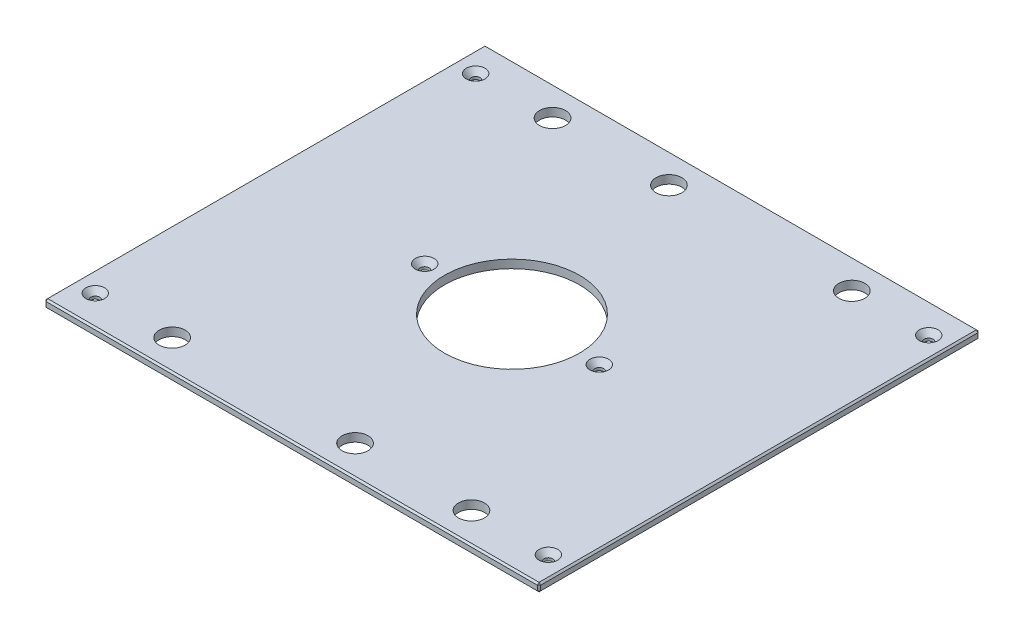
from build123d import *

# Parameters (mm, degrees)
SKETCH1_W                                     = 377.825
SKETCH1_H                                     = 336.55
BOSS_EXTRUDE1_DEPTH                           = 6.35
SKETCH13_R                                    = 51.562
CUT_EXTRUDE6_DEPTH                            = 254.07060434
F_25_32_0_78125_DIAMETER_HOLE1_D              = 19.84375
CHAMFER2_SIZE                                 = 1.27
CSK_FOR_1_4_FLAT_HEAD_MACHINE_SCREW1_AT_COUNT = 2
CSK_FOR_1_4_FLAT_HEAD_MACHINE_SCREW1_AT_PITCH = 290.50996
CSK_FOR_1_4_FLAT_HEAD_MACHINE_SCREW1_2_COUNT  = 2
CSK_FOR_1_4_FLAT_HEAD_MACHINE_SCREW1_2_PITCH  = 451.845042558
CSK_FOR_1_4_FLAT_HEAD_MACHINE_SCREW1_3_COUNT  = 2
CSK_FOR_1_4_FLAT_HEAD_MACHINE_SCREW1_3_PITCH  = 280.287516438
CSK_FOR_1_4_FLAT_HEAD_MACHINE_SCREW1_4_COUNT  = 2
CSK_FOR_1_4_FLAT_HEAD_MACHINE_SCREW1_4_PITCH  = 180.0333042
CSK_FOR_1_4_FLAT_HEAD_MACHINE_SCREW1_5_COUNT  = 2
CSK_FOR_1_4_FLAT_HEAD_MACHINE_SCREW1_5_PITCH  = 346.075
CSK_FOR_1_4_FLAT_HEAD_MACHINE_SCREW1_6_COUNT  = 2
CSK_FOR_1_4_FLAT_HEAD_MACHINE_SCREW1_6_PITCH  = 287.3375
CSK_FOR_1_4_FLAT_HEAD_MACHINE_SCREW1_7_COUNT  = 2
CSK_FOR_1_4_FLAT_HEAD_MACHINE_SCREW1_7_PITCH  = 408.606015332


with BuildPart() as part:
    # Sketch1 → Boss-Extrude1 (new body)
    with BuildSketch(Plane(origin=(0, 0, 0), x_dir=(1, 0, 0), z_dir=(0, 1, 0))):
        Rectangle(SKETCH1_W, SKETCH1_H)
    extrude(amount=BOSS_EXTRUDE1_DEPTH)

    # Sketch13 → Cut-Extrude6 (cut, through all)
    with BuildSketch(Plane(origin=(0, 6.35, 0), x_dir=(1, 0, 0), z_dir=(0, 1, 0))):
        with Locations(Location((0, 0, 0), (0, 0, 270))):
            Circle(SKETCH13_R)
    extrude(amount=-CUT_EXTRUDE6_DEPTH, mode=Mode.SUBTRACT)

    # 25_32 _0.78125_ Diameter Hole1 (through all)
    with Locations(Plane(origin=(0, 6.35, 0), x_dir=(1, 0, 0), z_dir=(0, 1, 0))):
        with Locations((114.3, 145.25498), (-114.3, 145.25498), (114.3, -145.25498), (-114.3, -145.25498), (-25.4, 145.25498), (25.4, -145.25498)):
            Hole(F_25_32_0_78125_DIAMETER_HOLE1_D / 2)

    # Chamfer2
    chamfer2_edges = [part.edges().sort_by_distance(p)[0] for p in [
        (188.9125, 6.35, 0),
        (0, 6.35, -168.275),
        (-188.9125, 6.35, 0),
        (0, 0, -168.275),
        (188.9125, 0, 0),
        (0, 0, 168.275),
        (-188.9125, 0, 0),
        (0, 6.35, 168.275),
        (-188.9125, 3.175, -168.275),
        (188.9125, 3.175, -168.275),
        (188.9125, 3.175, 168.275),
        (-188.9125, 3.175, 168.275),
    ]]
    chamfer(chamfer2_edges, length=CHAMFER2_SIZE)

    # Sketch24 → CSK for 1_4 Flat Head Machine Screw1 (revolve, cut)
    with BuildSketch(Plane(origin=(173.0375, 6.35, -145.25498), x_dir=(0, 0, 1), z_dir=(1, 0, 0))):
        Polygon((0, 0), (0, 6.35), (3.3782, 6.35), (3.3782, 4.324464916), (7.1374, 0), align=None)
    csk_for_1_4_flat_head_machine_screw1 = revolve(axis=Axis((173.0375, 12.7, -145.25498), (0, -1, 0)), mode=Mode.SUBTRACT)

    # CSK for 1_4 Flat Head Machine Screw1 at: CSK for 1_4 Flat Head Machine Screw1 ×2
    with Locations(*[(0, 0, i * CSK_FOR_1_4_FLAT_HEAD_MACHINE_SCREW1_AT_PITCH) for i in range(1, CSK_FOR_1_4_FLAT_HEAD_MACHINE_SCREW1_AT_COUNT)]):
        add(csk_for_1_4_flat_head_machine_screw1, mode=Mode.SUBTRACT)

    # CSK for 1_4 Flat Head Machine Screw1 2: CSK for 1_4 Flat Head Machine Screw1 ×2
    with Locations(*[Vector(-0.7659152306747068, 0, 0.6429415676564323) * (i * CSK_FOR_1_4_FLAT_HEAD_MACHINE_SCREW1_2_PITCH) for i in range(1, CSK_FOR_1_4_FLAT_HEAD_MACHINE_SCREW1_2_COUNT)]):
        add(csk_for_1_4_flat_head_machine_screw1, mode=Mode.SUBTRACT)

    # CSK for 1_4 Flat Head Machine Screw1 3: CSK for 1_4 Flat Head Machine Screw1 ×2
    with Locations(*[Vector(-0.8552378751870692, 0, 0.5182356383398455) * (i * CSK_FOR_1_4_FLAT_HEAD_MACHINE_SCREW1_3_PITCH) for i in range(1, CSK_FOR_1_4_FLAT_HEAD_MACHINE_SCREW1_3_COUNT)]):
        add(csk_for_1_4_flat_head_machine_screw1, mode=Mode.SUBTRACT)

    # CSK for 1_4 Flat Head Machine Screw1 4: CSK for 1_4 Flat Head Machine Screw1 ×2
    with Locations(*[Vector(-0.5907934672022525, 0, 0.8068228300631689) * (i * CSK_FOR_1_4_FLAT_HEAD_MACHINE_SCREW1_4_PITCH) for i in range(1, CSK_FOR_1_4_FLAT_HEAD_MACHINE_SCREW1_4_COUNT)]):
        add(csk_for_1_4_flat_head_machine_screw1, mode=Mode.SUBTRACT)

    # CSK for 1_4 Flat Head Machine Screw1 5: CSK for 1_4 Flat Head Machine Screw1 ×2
    with Locations(*[(-i * CSK_FOR_1_4_FLAT_HEAD_MACHINE_SCREW1_5_PITCH, 0, 0) for i in range(1, CSK_FOR_1_4_FLAT_HEAD_MACHINE_SCREW1_5_COUNT)]):
        add(csk_for_1_4_flat_head_machine_screw1, mode=Mode.SUBTRACT)

    # CSK for 1_4 Flat Head Machine Screw1 6: CSK for 1_4 Flat Head Machine Screw1 ×2
    with Locations(*[(-i * CSK_FOR_1_4_FLAT_HEAD_MACHINE_SCREW1_6_PITCH, 0, 0) for i in range(1, CSK_FOR_1_4_FLAT_HEAD_MACHINE_SCREW1_6_COUNT)]):
        add(csk_for_1_4_flat_head_machine_screw1, mode=Mode.SUBTRACT)

    # CSK for 1_4 Flat Head Machine Screw1 7: CSK for 1_4 Flat Head Machine Screw1 ×2
    with Locations(*[Vector(-0.7032140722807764, 0, 0.7109781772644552) * (i * CSK_FOR_1_4_FLAT_HEAD_MACHINE_SCREW1_7_PITCH) for i in range(1, CSK_FOR_1_4_FLAT_HEAD_MACHINE_SCREW1_7_COUNT)]):
        add(csk_for_1_4_flat_head_machine_screw1, mode=Mode.SUBTRACT)


solid = part.part
